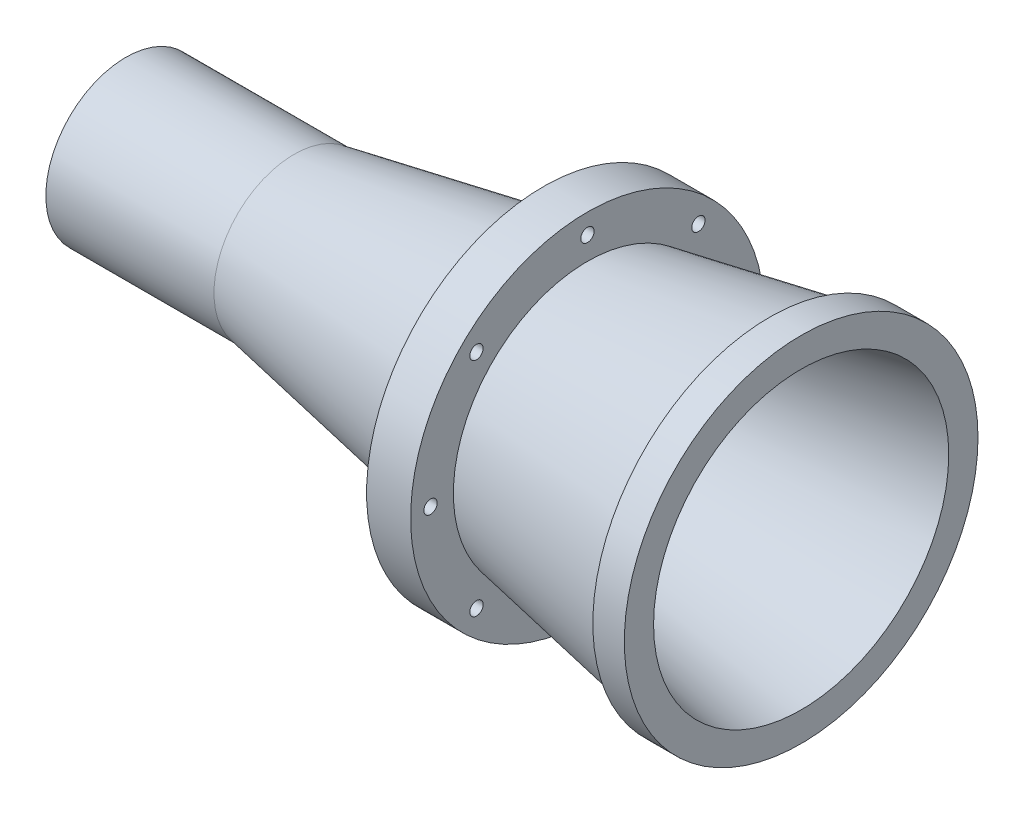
from build123d import *

# Parameters (mm, degrees)
F_1_4_20_TAPPED_HOLE1_REACH  = 236.802
F_1_4_20_TAPPED_HOLE1_BORE_R = 3.175
CIRPATTERN1_COUNT            = 8


with BuildPart() as part:
    # Sketch2 → Revolve3 (revolve)
    with BuildSketch(Plane.XY, mode=Mode.PRIVATE) as revolve3_sk:
        Polygon((-104.21433956, 46.589611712), (-24.20433956, 46.589611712), (94.452935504, 68.433611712), (94.452935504, 92.639811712), (115.407935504, 92.639811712), (115.407935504, 72.291285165), (202.10966044, 88.252485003), (202.10966044, 92.639811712), (217.09566044, 92.639811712), (217.09566044, 78.720611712), (-104.21433956, 19.919611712), align=None)
    revolve(revolve3_sk.sketch.rotate(Axis((217.09566044, 8.489611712, 0), (-1, 0, 0)), 90), axis=Axis((217.09566044, 8.489611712, 0), (-1, 0, 0)))

    # 1_4-20 Tapped Hole1 bore → 1_4-20 Tapped Hole1 (cut, up to next)
    with BuildSketch(Plane.ZY.offset(-94.452935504), mode=Mode.PRIVATE) as f_1_4_20_tapped_hole1_sk1:
        with Locations((0, 83.165611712)):
            Circle(F_1_4_20_TAPPED_HOLE1_BORE_R)
    f_1_4_20_tapped_hole1_tool1 = extrude(f_1_4_20_tapped_hole1_sk1.sketch, amount=-F_1_4_20_TAPPED_HOLE1_REACH, mode=Mode.PRIVATE) & part.part
    f_1_4_20_tapped_hole1 = f_1_4_20_tapped_hole1_tool1.solids().sort_by_distance((94.452936, 83.165612, 0))[0]
    add(f_1_4_20_tapped_hole1, mode=Mode.SUBTRACT)

    # CirPattern1: 1_4-20 Tapped Hole1 ×8 about axis
    cirpattern1_axis = Axis((0, 8.489611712, 0), (1, 0, 0))
    for i in range(1, CIRPATTERN1_COUNT):
        add(f_1_4_20_tapped_hole1.rotate(cirpattern1_axis, i * 360 / CIRPATTERN1_COUNT), mode=Mode.SUBTRACT)


solid = part.part
